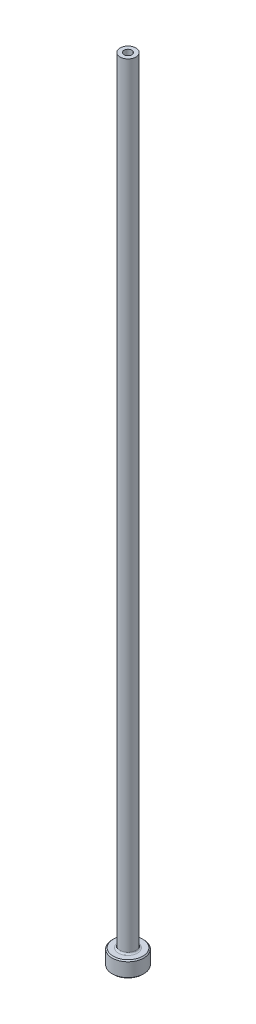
from build123d import *

# Parameters (mm, degrees)
FILLET1_R     = 0.3
CHAMFER1_SIZE = 0.2
CHAMFER3_SIZE = 0.5


with BuildPart() as part:
    # Sketch1 → Revolve1 (revolve)
    with BuildSketch(Plane.XY, mode=Mode.PRIVATE) as revolve1_sk:
        Polygon((-0.75, 150), (-1.5, 150), (-1.5, 3), (-3, 3), (-3, 0), (-1, 0), (-1, 103), (-0.75, 115), align=None)
    revolve(revolve1_sk.sketch.rotate(Axis((0, 92.187680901, 0), (0, -1, 0)), 270), axis=Axis((0, 92.187680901, 0), (0, -1, 0)))

    # Fillet1
    fillet1_edges = [part.edges().sort_by_distance(p)[0] for p in [
        (0, 3, -1.5),
    ]]
    fillet(fillet1_edges, radius=FILLET1_R)

    # Chamfer1
    chamfer1_edges = [part.edges().sort_by_distance(p)[0] for p in [
        (0, 0, -3),
        (0, 3, -3),
    ]]
    chamfer(chamfer1_edges, length=CHAMFER1_SIZE)

    # Chamfer3
    chamfer3_edges = [part.edges().sort_by_distance(p)[0] for p in [
        (0, 0, -1),
    ]]
    chamfer(chamfer3_edges, length=CHAMFER3_SIZE)


solid = part.part
